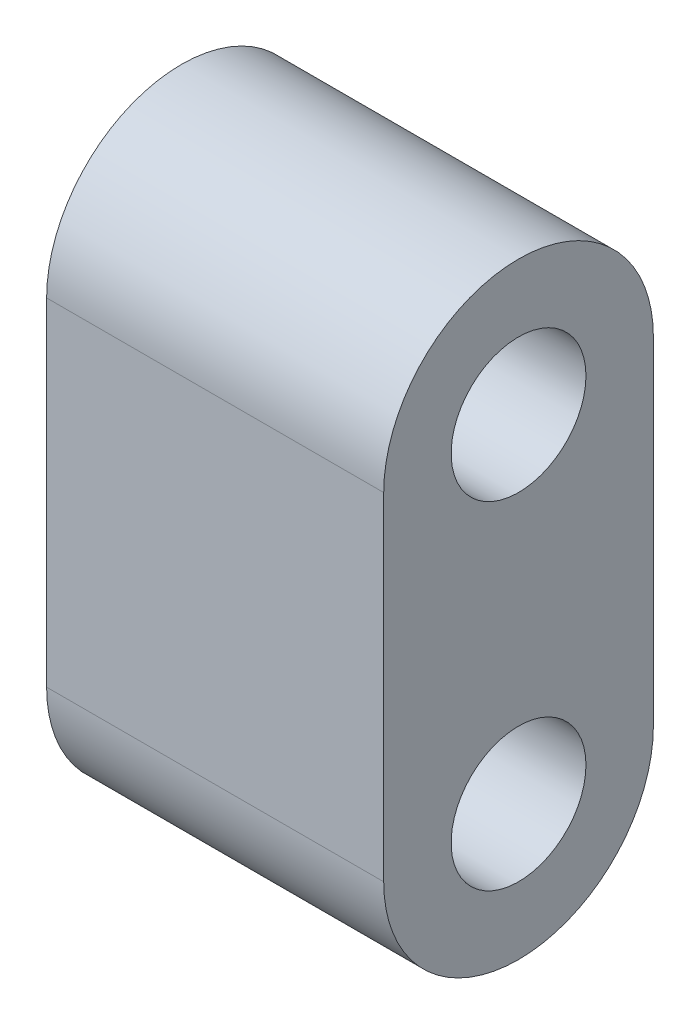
ISO-10303-21;
HEADER;
FILE_DESCRIPTION(('STEP AP214'),'2;1');
FILE_NAME('part.step','',(''),(''),'','','');
FILE_SCHEMA(('AUTOMOTIVE_DESIGN { 1 0 10303 214 1 1 1 1 }'));
ENDSEC;
DATA;
#1=APPLICATION_CONTEXT('core data for automotive mechanical design processes');
#2=APPLICATION_PROTOCOL_DEFINITION('international standard','automotive_design',2000,#1);
#3=PRODUCT_CONTEXT('',#1,'mechanical');
#4=PRODUCT('Part','Part','',(#3));
#5=PRODUCT_RELATED_PRODUCT_CATEGORY('part','',(#4));
#6=PRODUCT_DEFINITION_FORMATION('','',#4);
#7=PRODUCT_DEFINITION_CONTEXT('part definition',#1,'design');
#8=PRODUCT_DEFINITION('design','',#6,#7);
#9=PRODUCT_DEFINITION_SHAPE('','',#8);
#10=(LENGTH_UNIT() NAMED_UNIT(*) SI_UNIT(.MILLI.,.METRE.));
#11=(NAMED_UNIT(*) PLANE_ANGLE_UNIT() SI_UNIT($,.RADIAN.));
#12=(NAMED_UNIT(*) SI_UNIT($,.STERADIAN.) SOLID_ANGLE_UNIT());
#13=UNCERTAINTY_MEASURE_WITH_UNIT(LENGTH_MEASURE(1.E-05),#10,'distance_accuracy_value','');
#14=(GEOMETRIC_REPRESENTATION_CONTEXT(3) GLOBAL_UNCERTAINTY_ASSIGNED_CONTEXT((#13)) GLOBAL_UNIT_ASSIGNED_CONTEXT((#10,
#11,#12)) REPRESENTATION_CONTEXT('',''));
#15=CARTESIAN_POINT('',(0.,0.,0.));
#16=DIRECTION('',(0.,0.,1.));
#17=DIRECTION('',(1.,0.,0.));
#18=AXIS2_PLACEMENT_3D('',#15,#16,#17);
#19=CARTESIAN_POINT('',(5.,10.,0.));
#20=DIRECTION('',(1.,0.,0.));
#21=DIRECTION('',(0.,0.,-1.));
#22=AXIS2_PLACEMENT_3D('',#19,#20,#21);
#23=PLANE('',#22);
#24=CARTESIAN_POINT('',(5.,0.,0.));
#25=DIRECTION('',(1.,0.,0.));
#26=DIRECTION('',(0.,0.,-1.));
#27=AXIS2_PLACEMENT_3D('',#24,#25,#26);
#28=CIRCLE('',#27,2.);
#29=CARTESIAN_POINT('',(5.,0.,-2.));
#30=VERTEX_POINT('',#29);
#31=EDGE_CURVE('E100',#30,#30,#28,.T.);
#32=ORIENTED_EDGE('',*,*,#31,.F.);
#33=EDGE_LOOP('',(#32));
#34=FACE_BOUND('',#33,.T.);
#35=CARTESIAN_POINT('',(5.,10.,0.));
#36=DIRECTION('',(1.,0.,0.));
#37=DIRECTION('',(0.,0.,-1.));
#38=AXIS2_PLACEMENT_3D('',#35,#36,#37);
#39=CIRCLE('',#38,4.);
#40=CARTESIAN_POINT('',(5.,10.,-4.));
#41=VERTEX_POINT('',#40);
#42=CARTESIAN_POINT('',(5.,10.,4.));
#43=VERTEX_POINT('',#42);
#44=EDGE_CURVE('E85',#41,#43,#39,.T.);
#45=ORIENTED_EDGE('',*,*,#44,.T.);
#46=DIRECTION('',(0.,-1.,0.));
#47=VECTOR('',#46,1.);
#48=CARTESIAN_POINT('',(5.,10.,4.));
#49=LINE('',#48,#47);
#50=CARTESIAN_POINT('',(5.,0.,4.));
#51=VERTEX_POINT('',#50);
#52=EDGE_CURVE('E80',#43,#51,#49,.T.);
#53=ORIENTED_EDGE('',*,*,#52,.T.);
#54=CARTESIAN_POINT('',(5.,0.,0.));
#55=DIRECTION('',(1.,0.,0.));
#56=DIRECTION('',(0.,0.,1.));
#57=AXIS2_PLACEMENT_3D('',#54,#55,#56);
#58=CIRCLE('',#57,4.);
#59=CARTESIAN_POINT('',(5.,0.,-4.));
#60=VERTEX_POINT('',#59);
#61=EDGE_CURVE('E83',#51,#60,#58,.T.);
#62=ORIENTED_EDGE('',*,*,#61,.T.);
#63=DIRECTION('',(0.,1.,0.));
#64=VECTOR('',#63,1.);
#65=CARTESIAN_POINT('',(5.,10.,-4.));
#66=LINE('',#65,#64);
#67=EDGE_CURVE('E50',#60,#41,#66,.T.);
#68=ORIENTED_EDGE('',*,*,#67,.T.);
#69=EDGE_LOOP('',(#45,#53,#62,#68));
#70=FACE_BOUND('',#69,.T.);
#71=CARTESIAN_POINT('',(5.,10.,0.));
#72=DIRECTION('',(1.,0.,0.));
#73=DIRECTION('',(0.,0.,-1.));
#74=AXIS2_PLACEMENT_3D('',#71,#72,#73);
#75=CIRCLE('',#74,2.);
#76=CARTESIAN_POINT('',(5.,10.,-2.));
#77=VERTEX_POINT('',#76);
#78=EDGE_CURVE('E115',#77,#77,#75,.T.);
#79=ORIENTED_EDGE('',*,*,#78,.F.);
#80=EDGE_LOOP('',(#79));
#81=FACE_BOUND('',#80,.T.);
#82=ADVANCED_FACE('F33',(#34,#70,#81),#23,.T.);
#83=CARTESIAN_POINT('',(-5.,10.,0.));
#84=DIRECTION('',(1.,0.,0.));
#85=DIRECTION('',(0.,0.,-1.));
#86=AXIS2_PLACEMENT_3D('',#83,#84,#85);
#87=PLANE('',#86);
#88=CARTESIAN_POINT('',(-5.,0.,0.));
#89=DIRECTION('',(1.,0.,0.));
#90=DIRECTION('',(0.,0.,-1.));
#91=AXIS2_PLACEMENT_3D('',#88,#89,#90);
#92=CIRCLE('',#91,2.);
#93=CARTESIAN_POINT('',(-5.,0.,-2.));
#94=VERTEX_POINT('',#93);
#95=EDGE_CURVE('E112',#94,#94,#92,.T.);
#96=ORIENTED_EDGE('',*,*,#95,.T.);
#97=EDGE_LOOP('',(#96));
#98=FACE_BOUND('',#97,.T.);
#99=CARTESIAN_POINT('',(-5.,10.,0.));
#100=DIRECTION('',(1.,0.,0.));
#101=DIRECTION('',(0.,0.,-1.));
#102=AXIS2_PLACEMENT_3D('',#99,#100,#101);
#103=CIRCLE('',#102,4.);
#104=CARTESIAN_POINT('',(-5.,10.,-4.));
#105=VERTEX_POINT('',#104);
#106=CARTESIAN_POINT('',(-5.,10.,4.));
#107=VERTEX_POINT('',#106);
#108=EDGE_CURVE('E97',#105,#107,#103,.T.);
#109=ORIENTED_EDGE('',*,*,#108,.F.);
#110=DIRECTION('',(0.,1.,0.));
#111=VECTOR('',#110,1.);
#112=CARTESIAN_POINT('',(-5.,10.,-4.));
#113=LINE('',#112,#111);
#114=CARTESIAN_POINT('',(-5.,0.,-4.));
#115=VERTEX_POINT('',#114);
#116=EDGE_CURVE('E73',#115,#105,#113,.T.);
#117=ORIENTED_EDGE('',*,*,#116,.F.);
#118=CARTESIAN_POINT('',(-5.,0.,0.));
#119=DIRECTION('',(1.,0.,0.));
#120=DIRECTION('',(0.,0.,1.));
#121=AXIS2_PLACEMENT_3D('',#118,#119,#120);
#122=CIRCLE('',#121,4.);
#123=CARTESIAN_POINT('',(-5.,0.,4.));
#124=VERTEX_POINT('',#123);
#125=EDGE_CURVE('E67',#124,#115,#122,.T.);
#126=ORIENTED_EDGE('',*,*,#125,.F.);
#127=DIRECTION('',(0.,-1.,0.));
#128=VECTOR('',#127,1.);
#129=CARTESIAN_POINT('',(-5.,10.,4.));
#130=LINE('',#129,#128);
#131=EDGE_CURVE('E89',#107,#124,#130,.T.);
#132=ORIENTED_EDGE('',*,*,#131,.F.);
#133=EDGE_LOOP('',(#109,#117,#126,#132));
#134=FACE_BOUND('',#133,.T.);
#135=CARTESIAN_POINT('',(-5.,10.,0.));
#136=DIRECTION('',(1.,0.,0.));
#137=DIRECTION('',(0.,0.,-1.));
#138=AXIS2_PLACEMENT_3D('',#135,#136,#137);
#139=CIRCLE('',#138,2.);
#140=CARTESIAN_POINT('',(-5.,10.,-2.));
#141=VERTEX_POINT('',#140);
#142=EDGE_CURVE('E118',#141,#141,#139,.T.);
#143=ORIENTED_EDGE('',*,*,#142,.T.);
#144=EDGE_LOOP('',(#143));
#145=FACE_BOUND('',#144,.T.);
#146=ADVANCED_FACE('F108',(#98,#134,#145),#87,.F.);
#147=CARTESIAN_POINT('',(5.,10.,0.));
#148=DIRECTION('',(-1.,0.,0.));
#149=DIRECTION('',(0.,0.,1.));
#150=AXIS2_PLACEMENT_3D('',#147,#148,#149);
#151=CYLINDRICAL_SURFACE('',#150,4.);
#152=ORIENTED_EDGE('',*,*,#108,.T.);
#153=DIRECTION('',(-1.,0.,0.));
#154=VECTOR('',#153,1.);
#155=CARTESIAN_POINT('',(5.,10.,4.));
#156=LINE('',#155,#154);
#157=EDGE_CURVE('E11',#43,#107,#156,.T.);
#158=ORIENTED_EDGE('',*,*,#157,.F.);
#159=ORIENTED_EDGE('',*,*,#44,.F.);
#160=DIRECTION('',(-1.,0.,0.));
#161=VECTOR('',#160,1.);
#162=CARTESIAN_POINT('',(5.,10.,-4.));
#163=LINE('',#162,#161);
#164=EDGE_CURVE('E93',#41,#105,#163,.T.);
#165=ORIENTED_EDGE('',*,*,#164,.T.);
#166=EDGE_LOOP('',(#152,#158,#159,#165));
#167=FACE_BOUND('',#166,.T.);
#168=ADVANCED_FACE('F35',(#167),#151,.T.);
#169=CARTESIAN_POINT('',(5.,10.,4.));
#170=DIRECTION('',(0.,0.,-1.));
#171=DIRECTION('',(0.,1.,0.));
#172=AXIS2_PLACEMENT_3D('',#169,#170,#171);
#173=PLANE('',#172);
#174=ORIENTED_EDGE('',*,*,#131,.T.);
#175=DIRECTION('',(-1.,0.,0.));
#176=VECTOR('',#175,1.);
#177=CARTESIAN_POINT('',(5.,0.,4.));
#178=LINE('',#177,#176);
#179=EDGE_CURVE('E42',#51,#124,#178,.T.);
#180=ORIENTED_EDGE('',*,*,#179,.F.);
#181=ORIENTED_EDGE('',*,*,#52,.F.);
#182=ORIENTED_EDGE('',*,*,#157,.T.);
#183=EDGE_LOOP('',(#174,#180,#181,#182));
#184=FACE_BOUND('',#183,.T.);
#185=ADVANCED_FACE('F88',(#184),#173,.F.);
#186=CARTESIAN_POINT('',(5.,0.,0.));
#187=DIRECTION('',(-1.,0.,0.));
#188=DIRECTION('',(0.,0.,1.));
#189=AXIS2_PLACEMENT_3D('',#186,#187,#188);
#190=CYLINDRICAL_SURFACE('',#189,4.);
#191=ORIENTED_EDGE('',*,*,#125,.T.);
#192=DIRECTION('',(-1.,0.,0.));
#193=VECTOR('',#192,1.);
#194=CARTESIAN_POINT('',(5.,0.,-4.));
#195=LINE('',#194,#193);
#196=EDGE_CURVE('E90',#60,#115,#195,.T.);
#197=ORIENTED_EDGE('',*,*,#196,.F.);
#198=ORIENTED_EDGE('',*,*,#61,.F.);
#199=ORIENTED_EDGE('',*,*,#179,.T.);
#200=EDGE_LOOP('',(#191,#197,#198,#199));
#201=FACE_BOUND('',#200,.T.);
#202=ADVANCED_FACE('F91',(#201),#190,.T.);
#203=CARTESIAN_POINT('',(5.,10.,-4.));
#204=DIRECTION('',(0.,0.,1.));
#205=DIRECTION('',(0.,-1.,0.));
#206=AXIS2_PLACEMENT_3D('',#203,#204,#205);
#207=PLANE('',#206);
#208=ORIENTED_EDGE('',*,*,#116,.T.);
#209=ORIENTED_EDGE('',*,*,#164,.F.);
#210=ORIENTED_EDGE('',*,*,#67,.F.);
#211=ORIENTED_EDGE('',*,*,#196,.T.);
#212=EDGE_LOOP('',(#208,#209,#210,#211));
#213=FACE_BOUND('',#212,.T.);
#214=ADVANCED_FACE('F105',(#213),#207,.F.);
#215=CARTESIAN_POINT('',(5.,0.,0.));
#216=DIRECTION('',(-1.,0.,0.));
#217=DIRECTION('',(0.,0.,1.));
#218=AXIS2_PLACEMENT_3D('',#215,#216,#217);
#219=CYLINDRICAL_SURFACE('',#218,2.);
#220=ORIENTED_EDGE('',*,*,#31,.T.);
#221=EDGE_LOOP('',(#220));
#222=FACE_BOUND('',#221,.T.);
#223=ORIENTED_EDGE('',*,*,#95,.F.);
#224=EDGE_LOOP('',(#223));
#225=FACE_BOUND('',#224,.T.);
#226=ADVANCED_FACE('F136',(#222,#225),#219,.F.);
#227=CARTESIAN_POINT('',(5.,10.,0.));
#228=DIRECTION('',(-1.,0.,0.));
#229=DIRECTION('',(0.,0.,1.));
#230=AXIS2_PLACEMENT_3D('',#227,#228,#229);
#231=CYLINDRICAL_SURFACE('',#230,2.);
#232=ORIENTED_EDGE('',*,*,#78,.T.);
#233=EDGE_LOOP('',(#232));
#234=FACE_BOUND('',#233,.T.);
#235=ORIENTED_EDGE('',*,*,#142,.F.);
#236=EDGE_LOOP('',(#235));
#237=FACE_BOUND('',#236,.T.);
#238=ADVANCED_FACE('F124',(#234,#237),#231,.F.);
#239=CLOSED_SHELL('',(#82,#146,#168,#185,#202,#214,#226,#238));
#240=MANIFOLD_SOLID_BREP('B2',#239);
#241=ADVANCED_BREP_SHAPE_REPRESENTATION('',(#18,#240),#14);
#242=SHAPE_DEFINITION_REPRESENTATION(#9,#241);
ENDSEC;
END-ISO-10303-21;
